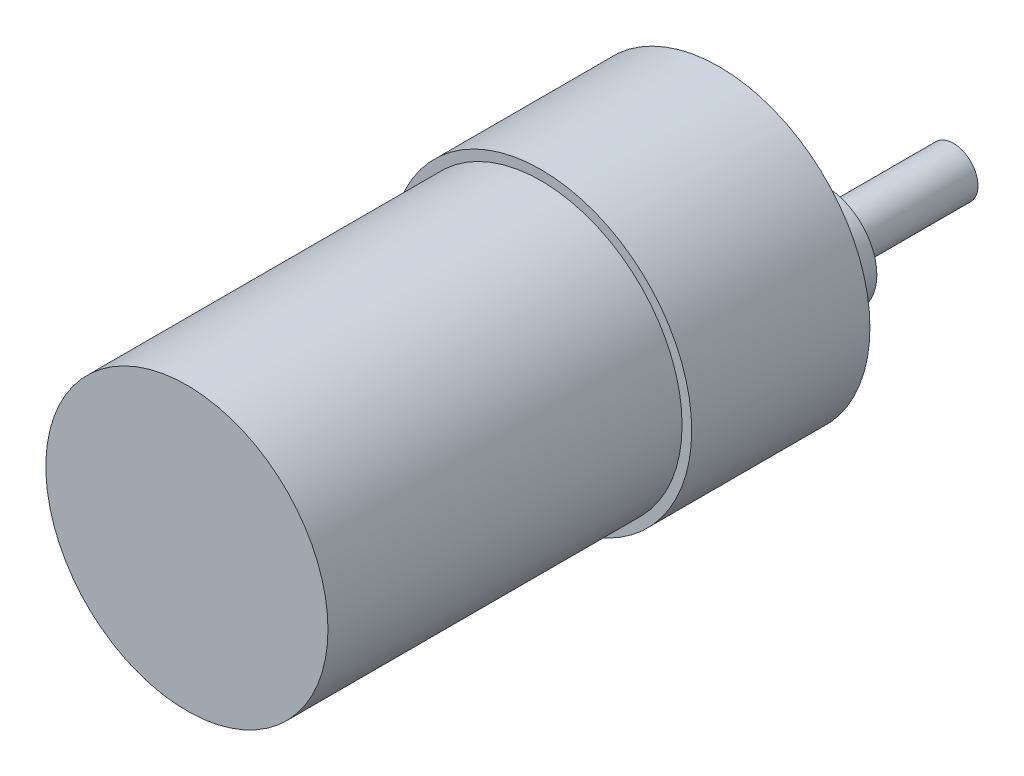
from build123d import *

# Parameters (mm, degrees)
SKETCH3_R                       = 18.4
BOSS_EXTRUDE1_DEPTH             = 21.76
SKETCH4_R                       = 17.225
BOSS_EXTRUDE2_DEPTH             = 65
M3X0_5_TAPPED_HOLE1_D           = 2.5
M3X0_5_TAPPED_HOLE1_DEPTH       = 4
M3X0_5_TAPPED_HOLE1_CBORE_D     = 3
M3X0_5_TAPPED_HOLE1_CBORE_DEPTH = 3.5
M3X0_5_TAPPED_HOLE1_TIP         = 0.751075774


with BuildPart() as part:
    # Sketch3 → Boss-Extrude1 (new body)
    with BuildSketch(Plane.XY):
        Circle(SKETCH3_R)
    extrude(amount=BOSS_EXTRUDE1_DEPTH)

    # Sketch4 → Boss-Extrude2 (add)
    with BuildSketch(Plane.XY):
        Circle(SKETCH4_R)
    extrude(amount=BOSS_EXTRUDE2_DEPTH)

    # Sketch5 → Revolve1 (revolve)
    with BuildSketch(Plane(origin=(0, 0, 0), x_dir=(1, 0, 0), z_dir=(0, 1, 0)), mode=Mode.PRIVATE) as revolve1_sk:
        Polygon((4, 21.6), (7, 21.6), (7, 0), (0.75, 0), (0.75, 6), (4, 6), align=None)
    revolve(revolve1_sk.sketch.rotate(Axis((7, 0, 0), (0, 0, -1)), 180), axis=Axis((7, 0, 0), (0, 0, -1)))

    # M3x0.5 Tapped Hole1
    with Locations(Plane(origin=(0, 0, 0), x_dir=(-1, 0, 0), z_dir=(0, 0, -1))):
        with Locations((13.423393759, 7.75), (0, 15.5), (-13.423393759, 7.75), (-13.423393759, -7.75), (0, -15.5), (13.423393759, -7.75)):
            CounterBoreHole(M3X0_5_TAPPED_HOLE1_D / 2, M3X0_5_TAPPED_HOLE1_CBORE_D / 2, M3X0_5_TAPPED_HOLE1_CBORE_DEPTH, depth=M3X0_5_TAPPED_HOLE1_DEPTH)
            with Locations((0, 0, -(M3X0_5_TAPPED_HOLE1_DEPTH + M3X0_5_TAPPED_HOLE1_TIP / 2))):  # 118° drill point
                Cone(0, M3X0_5_TAPPED_HOLE1_D / 2, M3X0_5_TAPPED_HOLE1_TIP, mode=Mode.SUBTRACT)


solid = part.part
